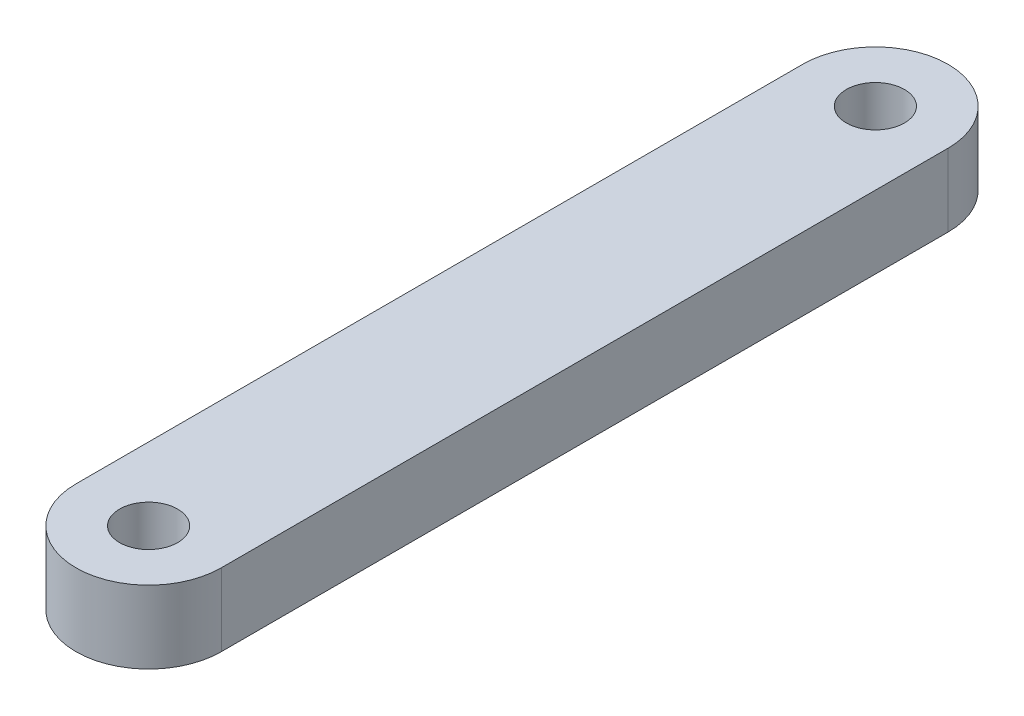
from build123d import *

# Parameters (mm, degrees)
SKETCH1_R           = 2
BOSS_EXTRUDE1_DEPTH = 5


with BuildPart() as part:
    # Sketch1 → Boss-Extrude1 (new body)
    with BuildSketch(Plane(origin=(0, 0, 0), x_dir=(1, 0, 0), z_dir=(0, 1, 0))):
        with BuildLine():
            Line((5, -25), (5, 25))
            ThreePointArc((5, 25), (0, 30), (-5, 25))
            Line((-5, 25), (-5, -25))
            ThreePointArc((-5, -25), (0, -30), (5, -25))
        make_face()
        with Locations(Location((0, 25, 0), (0, 0, 270))):
            Circle(SKETCH1_R, mode=Mode.SUBTRACT)
        with Locations(Location((0, -25, 0), (0, 0, 270))):
            Circle(SKETCH1_R, mode=Mode.SUBTRACT)
    extrude(amount=BOSS_EXTRUDE1_DEPTH)


solid = part.part
